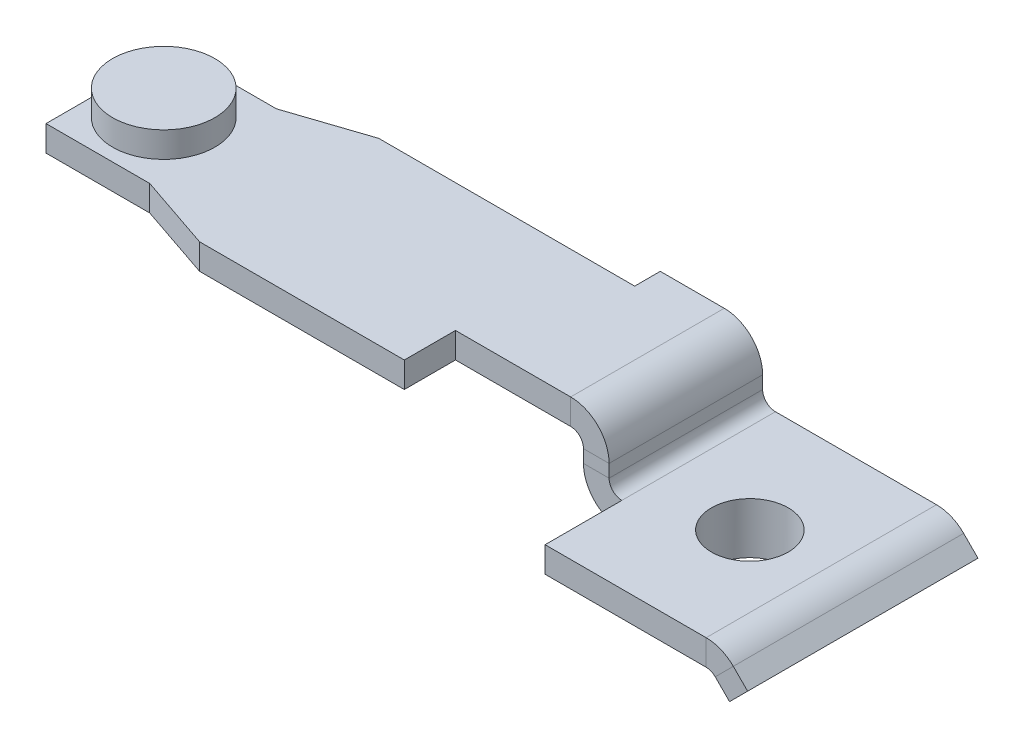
ISO-10303-21;
HEADER;
FILE_DESCRIPTION(('STEP AP214'),'2;1');
FILE_NAME('part.step','',(''),(''),'','','');
FILE_SCHEMA(('AUTOMOTIVE_DESIGN { 1 0 10303 214 1 1 1 1 }'));
ENDSEC;
DATA;
#1=APPLICATION_CONTEXT('core data for automotive mechanical design processes');
#2=APPLICATION_PROTOCOL_DEFINITION('international standard','automotive_design',2000,#1);
#3=PRODUCT_CONTEXT('',#1,'mechanical');
#4=PRODUCT('Part','Part','',(#3));
#5=PRODUCT_RELATED_PRODUCT_CATEGORY('part','',(#4));
#6=PRODUCT_DEFINITION_FORMATION('','',#4);
#7=PRODUCT_DEFINITION_CONTEXT('part definition',#1,'design');
#8=PRODUCT_DEFINITION('design','',#6,#7);
#9=PRODUCT_DEFINITION_SHAPE('','',#8);
#10=(LENGTH_UNIT() NAMED_UNIT(*) SI_UNIT(.MILLI.,.METRE.));
#11=(NAMED_UNIT(*) PLANE_ANGLE_UNIT() SI_UNIT($,.RADIAN.));
#12=(NAMED_UNIT(*) SI_UNIT($,.STERADIAN.) SOLID_ANGLE_UNIT());
#13=UNCERTAINTY_MEASURE_WITH_UNIT(LENGTH_MEASURE(1.E-05),#10,'distance_accuracy_value','');
#14=(GEOMETRIC_REPRESENTATION_CONTEXT(3) GLOBAL_UNCERTAINTY_ASSIGNED_CONTEXT((#13)) GLOBAL_UNIT_ASSIGNED_CONTEXT((#10,
#11,#12)) REPRESENTATION_CONTEXT('',''));
#15=CARTESIAN_POINT('',(0.,0.,0.));
#16=DIRECTION('',(0.,0.,1.));
#17=DIRECTION('',(1.,0.,0.));
#18=AXIS2_PLACEMENT_3D('',#15,#16,#17);
#19=CARTESIAN_POINT('',(-5.,3.49999999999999,1.5));
#20=DIRECTION('',(0.,1.,0.));
#21=DIRECTION('',(-1.,0.,0.));
#22=AXIS2_PLACEMENT_3D('',#19,#20,#21);
#23=PLANE('',#22);
#24=DIRECTION('',(0.,0.,-1.));
#25=VECTOR('',#24,1.);
#26=CARTESIAN_POINT('',(-25.,3.5,1.5));
#27=LINE('',#26,#25);
#28=CARTESIAN_POINT('',(-25.,3.5,-2.5));
#29=VERTEX_POINT('',#28);
#30=CARTESIAN_POINT('',(-25.,3.5,2.5));
#31=VERTEX_POINT('',#30);
#32=EDGE_CURVE('E289',#29,#31,#27,.F.);
#33=ORIENTED_EDGE('',*,*,#32,.T.);
#34=DIRECTION('',(-1.,0.,0.));
#35=VECTOR('',#34,1.);
#36=CARTESIAN_POINT('',(-25.,3.5,2.5));
#37=LINE('',#36,#35);
#38=CARTESIAN_POINT('',(-20.9464362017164,3.5,2.49999999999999));
#39=VERTEX_POINT('',#38);
#40=EDGE_CURVE('E263',#39,#31,#37,.T.);
#41=ORIENTED_EDGE('',*,*,#40,.F.);
#42=DIRECTION('',(-0.946947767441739,0.,-0.321387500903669));
#43=VECTOR('',#42,1.);
#44=CARTESIAN_POINT('',(-20.9464362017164,3.5,2.49999999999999));
#45=LINE('',#44,#43);
#46=CARTESIAN_POINT('',(-18.,3.5,3.5));
#47=VERTEX_POINT('',#46);
#48=EDGE_CURVE('E246',#47,#39,#45,.T.);
#49=ORIENTED_EDGE('',*,*,#48,.F.);
#50=DIRECTION('',(1.,0.,0.));
#51=VECTOR('',#50,1.);
#52=CARTESIAN_POINT('',(-10.,3.5,3.5));
#53=LINE('',#52,#51);
#54=CARTESIAN_POINT('',(-10.,3.5,3.5));
#55=VERTEX_POINT('',#54);
#56=EDGE_CURVE('E261',#47,#55,#53,.T.);
#57=ORIENTED_EDGE('',*,*,#56,.T.);
#58=DIRECTION('',(0.,0.,-1.));
#59=VECTOR('',#58,1.);
#60=CARTESIAN_POINT('',(-10.,3.5,1.5));
#61=LINE('',#60,#59);
#62=CARTESIAN_POINT('',(-10.,3.49999999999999,1.5));
#63=VERTEX_POINT('',#62);
#64=EDGE_CURVE('E271',#55,#63,#61,.T.);
#65=ORIENTED_EDGE('',*,*,#64,.T.);
#66=DIRECTION('',(-1.,0.,0.));
#67=VECTOR('',#66,1.);
#68=CARTESIAN_POINT('',(-5.,3.49999999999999,1.5));
#69=LINE('',#68,#67);
#70=CARTESIAN_POINT('',(-5.5,3.49999999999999,1.5));
#71=VERTEX_POINT('',#70);
#72=EDGE_CURVE('E286',#63,#71,#69,.F.);
#73=ORIENTED_EDGE('',*,*,#72,.T.);
#74=DIRECTION('',(0.,0.,-1.));
#75=VECTOR('',#74,1.);
#76=CARTESIAN_POINT('',(-5.5,3.49999999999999,1.5));
#77=LINE('',#76,#75);
#78=CARTESIAN_POINT('',(-5.5,3.49999999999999,-4.5));
#79=VERTEX_POINT('',#78);
#80=EDGE_CURVE('E302',#71,#79,#77,.T.);
#81=ORIENTED_EDGE('',*,*,#80,.T.);
#82=DIRECTION('',(1.,0.,0.));
#83=VECTOR('',#82,1.);
#84=CARTESIAN_POINT('',(-5.00000000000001,3.49999999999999,-4.5));
#85=LINE('',#84,#83);
#86=CARTESIAN_POINT('',(-8.,3.49999999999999,-4.5));
#87=VERTEX_POINT('',#86);
#88=EDGE_CURVE('E291',#79,#87,#85,.F.);
#89=ORIENTED_EDGE('',*,*,#88,.T.);
#90=DIRECTION('',(0.,0.,-1.));
#91=VECTOR('',#90,1.);
#92=CARTESIAN_POINT('',(-8.,3.49999999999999,-4.5));
#93=LINE('',#92,#91);
#94=CARTESIAN_POINT('',(-8.,3.49999999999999,-3.5));
#95=VERTEX_POINT('',#94);
#96=EDGE_CURVE('E562',#95,#87,#93,.T.);
#97=ORIENTED_EDGE('',*,*,#96,.F.);
#98=DIRECTION('',(1.,0.,0.));
#99=VECTOR('',#98,1.);
#100=CARTESIAN_POINT('',(-25.,3.5,-3.49999999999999));
#101=LINE('',#100,#99);
#102=CARTESIAN_POINT('',(-18.,3.5,-3.5));
#103=VERTEX_POINT('',#102);
#104=EDGE_CURVE('E564',#103,#95,#101,.T.);
#105=ORIENTED_EDGE('',*,*,#104,.F.);
#106=DIRECTION('',(0.948683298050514,0.,-0.316227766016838));
#107=VECTOR('',#106,1.);
#108=CARTESIAN_POINT('',(-21.,3.5,-2.5));
#109=LINE('',#108,#107);
#110=CARTESIAN_POINT('',(-21.,3.5,-2.5));
#111=VERTEX_POINT('',#110);
#112=EDGE_CURVE('E580',#111,#103,#109,.T.);
#113=ORIENTED_EDGE('',*,*,#112,.F.);
#114=DIRECTION('',(1.,0.,0.));
#115=VECTOR('',#114,1.);
#116=CARTESIAN_POINT('',(-25.,3.5,-2.5));
#117=LINE('',#116,#115);
#118=EDGE_CURVE('E582',#29,#111,#117,.T.);
#119=ORIENTED_EDGE('',*,*,#118,.F.);
#120=EDGE_LOOP('',(#33,#41,#49,#57,#65,#73,#81,#89,#97,#105,#113,#119));
#121=FACE_BOUND('',#120,.T.);
#122=CARTESIAN_POINT('',(-22.9,3.5,0.));
#123=DIRECTION('',(0.,1.,0.));
#124=DIRECTION('',(-1.,0.,0.));
#125=AXIS2_PLACEMENT_3D('',#122,#123,#124);
#126=CIRCLE('',#125,2.);
#127=CARTESIAN_POINT('',(-24.9,3.5,0.));
#128=VERTEX_POINT('',#127);
#129=EDGE_CURVE('E593',#128,#128,#126,.T.);
#130=ORIENTED_EDGE('',*,*,#129,.F.);
#131=EDGE_LOOP('',(#130));
#132=FACE_BOUND('',#131,.T.);
#133=ADVANCED_FACE('F68',(#121,#132),#23,.T.);
#134=CARTESIAN_POINT('',(-5.,2.49999999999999,1.5));
#135=DIRECTION('',(0.,1.,0.));
#136=DIRECTION('',(-1.,0.,0.));
#137=AXIS2_PLACEMENT_3D('',#134,#135,#136);
#138=PLANE('',#137);
#139=DIRECTION('',(-1.,0.,0.));
#140=VECTOR('',#139,1.);
#141=CARTESIAN_POINT('',(-5.,2.49999999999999,2.49999999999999));
#142=LINE('',#141,#140);
#143=CARTESIAN_POINT('',(-20.9464362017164,2.5,2.49999999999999));
#144=VERTEX_POINT('',#143);
#145=CARTESIAN_POINT('',(-25.,2.5,2.5));
#146=VERTEX_POINT('',#145);
#147=EDGE_CURVE('E254',#144,#146,#142,.T.);
#148=ORIENTED_EDGE('',*,*,#147,.T.);
#149=DIRECTION('',(0.,0.,1.));
#150=VECTOR('',#149,1.);
#151=CARTESIAN_POINT('',(-25.,2.5,1.5));
#152=LINE('',#151,#150);
#153=CARTESIAN_POINT('',(-25.,2.5,-2.5));
#154=VERTEX_POINT('',#153);
#155=EDGE_CURVE('E296',#154,#146,#152,.T.);
#156=ORIENTED_EDGE('',*,*,#155,.F.);
#157=DIRECTION('',(-1.,0.,0.));
#158=VECTOR('',#157,1.);
#159=CARTESIAN_POINT('',(-5.,2.49999999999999,-2.5));
#160=LINE('',#159,#158);
#161=CARTESIAN_POINT('',(-21.,2.5,-2.5));
#162=VERTEX_POINT('',#161);
#163=EDGE_CURVE('E577',#154,#162,#160,.F.);
#164=ORIENTED_EDGE('',*,*,#163,.T.);
#165=DIRECTION('',(0.948683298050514,0.,-0.316227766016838));
#166=VECTOR('',#165,1.);
#167=CARTESIAN_POINT('',(-21.,2.5,-2.5));
#168=LINE('',#167,#166);
#169=CARTESIAN_POINT('',(-18.,2.5,-3.5));
#170=VERTEX_POINT('',#169);
#171=EDGE_CURVE('E571',#162,#170,#168,.T.);
#172=ORIENTED_EDGE('',*,*,#171,.T.);
#173=DIRECTION('',(1.,0.,0.));
#174=VECTOR('',#173,1.);
#175=CARTESIAN_POINT('',(-25.,2.5,-3.49999999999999));
#176=LINE('',#175,#174);
#177=CARTESIAN_POINT('',(-8.,2.49999999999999,-3.5));
#178=VERTEX_POINT('',#177);
#179=EDGE_CURVE('E560',#170,#178,#176,.T.);
#180=ORIENTED_EDGE('',*,*,#179,.T.);
#181=DIRECTION('',(0.,0.,-1.));
#182=VECTOR('',#181,1.);
#183=CARTESIAN_POINT('',(-8.,2.49999999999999,-4.5));
#184=LINE('',#183,#182);
#185=CARTESIAN_POINT('',(-8.,2.49999999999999,-4.5));
#186=VERTEX_POINT('',#185);
#187=EDGE_CURVE('E557',#178,#186,#184,.T.);
#188=ORIENTED_EDGE('',*,*,#187,.T.);
#189=DIRECTION('',(-1.,0.,0.));
#190=VECTOR('',#189,1.);
#191=CARTESIAN_POINT('',(-25.,2.5,-4.49999999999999));
#192=LINE('',#191,#190);
#193=CARTESIAN_POINT('',(-5.5,2.49999999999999,-4.5));
#194=VERTEX_POINT('',#193);
#195=EDGE_CURVE('E299',#194,#186,#192,.T.);
#196=ORIENTED_EDGE('',*,*,#195,.F.);
#197=DIRECTION('',(0.,0.,1.));
#198=VECTOR('',#197,1.);
#199=CARTESIAN_POINT('',(-5.5,2.49999999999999,1.5));
#200=LINE('',#199,#198);
#201=CARTESIAN_POINT('',(-5.5,2.49999999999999,1.5));
#202=VERTEX_POINT('',#201);
#203=EDGE_CURVE('E308',#202,#194,#200,.F.);
#204=ORIENTED_EDGE('',*,*,#203,.F.);
#205=DIRECTION('',(1.,0.,0.));
#206=VECTOR('',#205,1.);
#207=CARTESIAN_POINT('',(-5.,2.49999999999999,1.5));
#208=LINE('',#207,#206);
#209=CARTESIAN_POINT('',(-10.,2.49999999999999,1.5));
#210=VERTEX_POINT('',#209);
#211=EDGE_CURVE('E294',#210,#202,#208,.T.);
#212=ORIENTED_EDGE('',*,*,#211,.F.);
#213=DIRECTION('',(0.,0.,-1.));
#214=VECTOR('',#213,1.);
#215=CARTESIAN_POINT('',(-10.,2.5,1.5));
#216=LINE('',#215,#214);
#217=CARTESIAN_POINT('',(-10.,2.5,3.5));
#218=VERTEX_POINT('',#217);
#219=EDGE_CURVE('E270',#218,#210,#216,.T.);
#220=ORIENTED_EDGE('',*,*,#219,.F.);
#221=DIRECTION('',(1.,0.,0.));
#222=VECTOR('',#221,1.);
#223=CARTESIAN_POINT('',(-10.,2.5,3.5));
#224=LINE('',#223,#222);
#225=CARTESIAN_POINT('',(-18.,2.5,3.5));
#226=VERTEX_POINT('',#225);
#227=EDGE_CURVE('E274',#226,#218,#224,.T.);
#228=ORIENTED_EDGE('',*,*,#227,.F.);
#229=DIRECTION('',(-0.946947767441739,0.,-0.321387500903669));
#230=VECTOR('',#229,1.);
#231=CARTESIAN_POINT('',(-20.9464362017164,2.5,2.49999999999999));
#232=LINE('',#231,#230);
#233=EDGE_CURVE('E249',#226,#144,#232,.T.);
#234=ORIENTED_EDGE('',*,*,#233,.T.);
#235=EDGE_LOOP('',(#148,#156,#164,#172,#180,#188,#196,#204,#212,#220,#228,#234));
#236=FACE_BOUND('',#235,.T.);
#237=ADVANCED_FACE('F599',(#236),#138,.F.);
#238=CARTESIAN_POINT('',(-25.,3.5,1.5));
#239=DIRECTION('',(1.,0.,0.));
#240=DIRECTION('',(0.,1.,0.));
#241=AXIS2_PLACEMENT_3D('',#238,#239,#240);
#242=PLANE('',#241);
#243=DIRECTION('',(0.,1.,0.));
#244=VECTOR('',#243,1.);
#245=CARTESIAN_POINT('',(-25.,3.5,2.5));
#246=LINE('',#245,#244);
#247=EDGE_CURVE('E253',#31,#146,#246,.F.);
#248=ORIENTED_EDGE('',*,*,#247,.F.);
#249=ORIENTED_EDGE('',*,*,#32,.F.);
#250=DIRECTION('',(0.,1.,0.));
#251=VECTOR('',#250,1.);
#252=CARTESIAN_POINT('',(-25.,3.5,-2.5));
#253=LINE('',#252,#251);
#254=EDGE_CURVE('E570',#29,#154,#253,.F.);
#255=ORIENTED_EDGE('',*,*,#254,.T.);
#256=ORIENTED_EDGE('',*,*,#155,.T.);
#257=EDGE_LOOP('',(#248,#249,#255,#256));
#258=FACE_BOUND('',#257,.T.);
#259=ADVANCED_FACE('F606',(#258),#242,.F.);
#260=CARTESIAN_POINT('',(-10.,2.5,3.5));
#261=DIRECTION('',(0.,0.,1.));
#262=DIRECTION('',(0.,-1.,0.));
#263=AXIS2_PLACEMENT_3D('',#260,#261,#262);
#264=PLANE('',#263);
#265=ORIENTED_EDGE('',*,*,#56,.F.);
#266=DIRECTION('',(0.,1.,0.));
#267=VECTOR('',#266,1.);
#268=CARTESIAN_POINT('',(-18.,3.5,3.5));
#269=LINE('',#268,#267);
#270=EDGE_CURVE('E242',#47,#226,#269,.F.);
#271=ORIENTED_EDGE('',*,*,#270,.T.);
#272=ORIENTED_EDGE('',*,*,#227,.T.);
#273=DIRECTION('',(0.,1.,0.));
#274=VECTOR('',#273,1.);
#275=CARTESIAN_POINT('',(-10.,2.5,3.5));
#276=LINE('',#275,#274);
#277=EDGE_CURVE('E268',#218,#55,#276,.T.);
#278=ORIENTED_EDGE('',*,*,#277,.T.);
#279=EDGE_LOOP('',(#265,#271,#272,#278));
#280=FACE_BOUND('',#279,.T.);
#281=ADVANCED_FACE('F266',(#280),#264,.T.);
#282=CARTESIAN_POINT('',(-25.,2.5,-3.49999999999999));
#283=DIRECTION('',(0.,0.,1.));
#284=DIRECTION('',(1.,0.,0.));
#285=AXIS2_PLACEMENT_3D('',#282,#283,#284);
#286=PLANE('',#285);
#287=DIRECTION('',(0.,1.,0.));
#288=VECTOR('',#287,1.);
#289=CARTESIAN_POINT('',(-18.,3.5,-3.5));
#290=LINE('',#289,#288);
#291=EDGE_CURVE('E566',#103,#170,#290,.F.);
#292=ORIENTED_EDGE('',*,*,#291,.F.);
#293=ORIENTED_EDGE('',*,*,#104,.T.);
#294=DIRECTION('',(0.,1.,0.));
#295=VECTOR('',#294,1.);
#296=CARTESIAN_POINT('',(-8.,2.49999999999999,-3.5));
#297=LINE('',#296,#295);
#298=EDGE_CURVE('E554',#178,#95,#297,.T.);
#299=ORIENTED_EDGE('',*,*,#298,.F.);
#300=ORIENTED_EDGE('',*,*,#179,.F.);
#301=EDGE_LOOP('',(#292,#293,#299,#300));
#302=FACE_BOUND('',#301,.T.);
#303=ADVANCED_FACE('F689',(#302),#286,.F.);
#304=CARTESIAN_POINT('',(-3.5,0.,4.5));
#305=DIRECTION('',(0.,1.,0.));
#306=DIRECTION('',(0.,0.,1.));
#307=AXIS2_PLACEMENT_3D('',#304,#305,#306);
#308=PLANE('',#307);
#309=DIRECTION('',(0.,0.,1.));
#310=VECTOR('',#309,1.);
#311=CARTESIAN_POINT('',(2.79289321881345,0.,4.5));
#312=LINE('',#311,#310);
#313=CARTESIAN_POINT('',(2.79289321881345,0.,-1.09532984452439));
#314=VERTEX_POINT('',#313);
#315=CARTESIAN_POINT('',(2.79289321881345,0.,-4.5));
#316=VERTEX_POINT('',#315);
#317=EDGE_CURVE('E360',#314,#316,#312,.F.);
#318=ORIENTED_EDGE('',*,*,#317,.F.);
#319=CARTESIAN_POINT('',(0.,0.,0.));
#320=DIRECTION('',(0.,1.,0.));
#321=DIRECTION('',(0.,0.,1.));
#322=AXIS2_PLACEMENT_3D('',#319,#320,#321);
#323=CIRCLE('',#322,3.);
#324=CARTESIAN_POINT('',(2.79289321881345,0.,1.09532984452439));
#325=VERTEX_POINT('',#324);
#326=EDGE_CURVE('E81',#314,#325,#323,.T.);
#327=ORIENTED_EDGE('',*,*,#326,.T.);
#328=CARTESIAN_POINT('',(2.79289321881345,0.,4.5));
#329=VERTEX_POINT('',#328);
#330=EDGE_CURVE('E358',#329,#325,#312,.F.);
#331=ORIENTED_EDGE('',*,*,#330,.F.);
#332=DIRECTION('',(1.,0.,0.));
#333=VECTOR('',#332,1.);
#334=CARTESIAN_POINT('',(-3.5,0.,4.5));
#335=LINE('',#334,#333);
#336=CARTESIAN_POINT('',(-3.5,0.,4.5));
#337=VERTEX_POINT('',#336);
#338=EDGE_CURVE('E507',#337,#329,#335,.T.);
#339=ORIENTED_EDGE('',*,*,#338,.F.);
#340=DIRECTION('',(0.,0.,1.));
#341=VECTOR('',#340,1.);
#342=CARTESIAN_POINT('',(-3.5,0.,-4.5));
#343=LINE('',#342,#341);
#344=CARTESIAN_POINT('',(-3.5,0.,1.5));
#345=VERTEX_POINT('',#344);
#346=EDGE_CURVE('E434',#345,#337,#343,.T.);
#347=ORIENTED_EDGE('',*,*,#346,.F.);
#348=CARTESIAN_POINT('',(-3.5,0.,-4.5));
#349=VERTEX_POINT('',#348);
#350=EDGE_CURVE('E504',#349,#345,#343,.T.);
#351=ORIENTED_EDGE('',*,*,#350,.F.);
#352=DIRECTION('',(-1.,0.,0.));
#353=VECTOR('',#352,1.);
#354=CARTESIAN_POINT('',(-3.5,0.,-4.5));
#355=LINE('',#354,#353);
#356=EDGE_CURVE('E510',#316,#349,#355,.T.);
#357=ORIENTED_EDGE('',*,*,#356,.F.);
#358=EDGE_LOOP('',(#318,#327,#331,#339,#347,#351,#357));
#359=FACE_BOUND('',#358,.T.);
#360=ADVANCED_FACE('F446',(#359),#308,.F.);
#361=CARTESIAN_POINT('',(-3.5,1.,4.5));
#362=DIRECTION('',(0.,0.,-1.));
#363=DIRECTION('',(-1.,0.,0.));
#364=AXIS2_PLACEMENT_3D('',#361,#362,#363);
#365=PLANE('',#364);
#366=DIRECTION('',(0.,1.,0.));
#367=VECTOR('',#366,1.);
#368=CARTESIAN_POINT('',(2.79289321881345,0.,4.5));
#369=LINE('',#368,#367);
#370=CARTESIAN_POINT('',(2.79289321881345,1.,4.5));
#371=VERTEX_POINT('',#370);
#372=EDGE_CURVE('E369',#329,#371,#369,.T.);
#373=ORIENTED_EDGE('',*,*,#372,.T.);
#374=DIRECTION('',(1.,0.,0.));
#375=VECTOR('',#374,1.);
#376=CARTESIAN_POINT('',(-3.5,1.,4.5));
#377=LINE('',#376,#375);
#378=CARTESIAN_POINT('',(-3.5,1.,4.5));
#379=VERTEX_POINT('',#378);
#380=EDGE_CURVE('E490',#379,#371,#377,.T.);
#381=ORIENTED_EDGE('',*,*,#380,.F.);
#382=DIRECTION('',(0.,-1.,0.));
#383=VECTOR('',#382,1.);
#384=CARTESIAN_POINT('',(-3.5,1.,4.5));
#385=LINE('',#384,#383);
#386=EDGE_CURVE('E443',#379,#337,#385,.T.);
#387=ORIENTED_EDGE('',*,*,#386,.T.);
#388=ORIENTED_EDGE('',*,*,#338,.T.);
#389=EDGE_LOOP('',(#373,#381,#387,#388));
#390=FACE_BOUND('',#389,.T.);
#391=ADVANCED_FACE('F515',(#390),#365,.F.);
#392=CARTESIAN_POINT('',(-3.5,1.,-4.5));
#393=DIRECTION('',(0.,0.,1.));
#394=DIRECTION('',(1.,0.,0.));
#395=AXIS2_PLACEMENT_3D('',#392,#393,#394);
#396=PLANE('',#395);
#397=DIRECTION('',(0.,1.,0.));
#398=VECTOR('',#397,1.);
#399=CARTESIAN_POINT('',(2.79289321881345,0.,-4.5));
#400=LINE('',#399,#398);
#401=CARTESIAN_POINT('',(2.79289321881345,1.,-4.5));
#402=VERTEX_POINT('',#401);
#403=EDGE_CURVE('E372',#316,#402,#400,.T.);
#404=ORIENTED_EDGE('',*,*,#403,.F.);
#405=ORIENTED_EDGE('',*,*,#356,.T.);
#406=DIRECTION('',(0.,-1.,0.));
#407=VECTOR('',#406,1.);
#408=CARTESIAN_POINT('',(-3.5,1.,-4.5));
#409=LINE('',#408,#407);
#410=CARTESIAN_POINT('',(-3.5,1.,-4.5));
#411=VERTEX_POINT('',#410);
#412=EDGE_CURVE('E494',#411,#349,#409,.T.);
#413=ORIENTED_EDGE('',*,*,#412,.F.);
#414=DIRECTION('',(-1.,0.,0.));
#415=VECTOR('',#414,1.);
#416=CARTESIAN_POINT('',(-3.5,1.,-4.5));
#417=LINE('',#416,#415);
#418=EDGE_CURVE('E487',#402,#411,#417,.T.);
#419=ORIENTED_EDGE('',*,*,#418,.F.);
#420=EDGE_LOOP('',(#404,#405,#413,#419));
#421=FACE_BOUND('',#420,.T.);
#422=ADVANCED_FACE('F492',(#421),#396,.F.);
#423=CARTESIAN_POINT('',(-3.5,1.,4.5));
#424=DIRECTION('',(0.,1.,0.));
#425=DIRECTION('',(0.,0.,1.));
#426=AXIS2_PLACEMENT_3D('',#423,#424,#425);
#427=PLANE('',#426);
#428=CARTESIAN_POINT('',(0.,1.,0.));
#429=DIRECTION('',(0.,1.,0.));
#430=DIRECTION('',(0.,0.,1.));
#431=AXIS2_PLACEMENT_3D('',#428,#429,#430);
#432=CIRCLE('',#431,1.5);
#433=CARTESIAN_POINT('',(0.,1.,1.5));
#434=VERTEX_POINT('',#433);
#435=EDGE_CURVE('E383',#434,#434,#432,.T.);
#436=ORIENTED_EDGE('',*,*,#435,.F.);
#437=EDGE_LOOP('',(#436));
#438=FACE_BOUND('',#437,.T.);
#439=ORIENTED_EDGE('',*,*,#380,.T.);
#440=DIRECTION('',(0.,0.,1.));
#441=VECTOR('',#440,1.);
#442=CARTESIAN_POINT('',(2.79289321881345,1.,4.5));
#443=LINE('',#442,#441);
#444=EDGE_CURVE('E363',#371,#402,#443,.F.);
#445=ORIENTED_EDGE('',*,*,#444,.T.);
#446=ORIENTED_EDGE('',*,*,#418,.T.);
#447=DIRECTION('',(0.,0.,1.));
#448=VECTOR('',#447,1.);
#449=CARTESIAN_POINT('',(-3.5,1.,-4.5));
#450=LINE('',#449,#448);
#451=CARTESIAN_POINT('',(-3.5,1.,1.5));
#452=VERTEX_POINT('',#451);
#453=EDGE_CURVE('E497',#411,#452,#450,.T.);
#454=ORIENTED_EDGE('',*,*,#453,.T.);
#455=EDGE_CURVE('E508',#452,#379,#450,.T.);
#456=ORIENTED_EDGE('',*,*,#455,.T.);
#457=EDGE_LOOP('',(#439,#445,#446,#454,#456));
#458=FACE_BOUND('',#457,.T.);
#459=ADVANCED_FACE('F485',(#438,#458),#427,.T.);
#460=CARTESIAN_POINT('',(-3.5,1.,-4.5));
#461=DIRECTION('',(1.,0.,0.));
#462=DIRECTION('',(0.,0.,-1.));
#463=AXIS2_PLACEMENT_3D('',#460,#461,#462);
#464=PLANE('',#463);
#465=ORIENTED_EDGE('',*,*,#455,.F.);
#466=DIRECTION('',(0.,-1.,0.));
#467=VECTOR('',#466,1.);
#468=CARTESIAN_POINT('',(-3.5,1.,1.5));
#469=LINE('',#468,#467);
#470=EDGE_CURVE('E425',#452,#345,#469,.T.);
#471=ORIENTED_EDGE('',*,*,#470,.T.);
#472=ORIENTED_EDGE('',*,*,#346,.T.);
#473=ORIENTED_EDGE('',*,*,#386,.F.);
#474=EDGE_LOOP('',(#465,#471,#472,#473));
#475=FACE_BOUND('',#474,.T.);
#476=ADVANCED_FACE('F70',(#475),#464,.F.);
#477=CARTESIAN_POINT('',(-3.5,1.5,-4.5));
#478=DIRECTION('',(0.,0.,-1.));
#479=DIRECTION('',(-1.,0.,0.));
#480=AXIS2_PLACEMENT_3D('',#477,#478,#479);
#481=PLANE('',#480);
#482=DIRECTION('',(1.,0.,0.));
#483=VECTOR('',#482,1.);
#484=CARTESIAN_POINT('',(-5.,1.5,-4.5));
#485=LINE('',#484,#483);
#486=CARTESIAN_POINT('',(-4.,1.5,-4.5));
#487=VERTEX_POINT('',#486);
#488=CARTESIAN_POINT('',(-5.,1.5,-4.5));
#489=VERTEX_POINT('',#488);
#490=EDGE_CURVE('E386',#487,#489,#485,.F.);
#491=ORIENTED_EDGE('',*,*,#490,.F.);
#492=CARTESIAN_POINT('',(-3.5,1.5,-4.5));
#493=DIRECTION('',(0.,0.,1.));
#494=DIRECTION('',(1.,0.,0.));
#495=AXIS2_PLACEMENT_3D('',#492,#493,#494);
#496=CIRCLE('',#495,0.5);
#497=EDGE_CURVE('E418',#411,#487,#496,.F.);
#498=ORIENTED_EDGE('',*,*,#497,.F.);
#499=ORIENTED_EDGE('',*,*,#412,.T.);
#500=CARTESIAN_POINT('',(-3.5,1.5,-4.5));
#501=DIRECTION('',(0.,0.,1.));
#502=DIRECTION('',(1.,0.,0.));
#503=AXIS2_PLACEMENT_3D('',#500,#501,#502);
#504=CIRCLE('',#503,1.5);
#505=EDGE_CURVE('E422',#349,#489,#504,.F.);
#506=ORIENTED_EDGE('',*,*,#505,.T.);
#507=EDGE_LOOP('',(#491,#498,#499,#506));
#508=FACE_BOUND('',#507,.T.);
#509=ADVANCED_FACE('F681',(#508),#481,.T.);
#510=CARTESIAN_POINT('',(-3.5,1.5,1.5));
#511=DIRECTION('',(0.,0.,-1.));
#512=DIRECTION('',(-1.,0.,0.));
#513=AXIS2_PLACEMENT_3D('',#510,#511,#512);
#514=PLANE('',#513);
#515=CARTESIAN_POINT('',(-3.5,1.5,1.5));
#516=DIRECTION('',(0.,0.,1.));
#517=DIRECTION('',(1.,0.,0.));
#518=AXIS2_PLACEMENT_3D('',#515,#516,#517);
#519=CIRCLE('',#518,0.5);
#520=CARTESIAN_POINT('',(-4.,1.5,1.5));
#521=VERTEX_POINT('',#520);
#522=EDGE_CURVE('E390',#521,#452,#519,.T.);
#523=ORIENTED_EDGE('',*,*,#522,.F.);
#524=DIRECTION('',(1.,0.,0.));
#525=VECTOR('',#524,1.);
#526=CARTESIAN_POINT('',(-4.,1.5,1.5));
#527=LINE('',#526,#525);
#528=CARTESIAN_POINT('',(-5.,1.5,1.5));
#529=VERTEX_POINT('',#528);
#530=EDGE_CURVE('E411',#521,#529,#527,.F.);
#531=ORIENTED_EDGE('',*,*,#530,.T.);
#532=CARTESIAN_POINT('',(-3.5,1.5,1.5));
#533=DIRECTION('',(0.,0.,1.));
#534=DIRECTION('',(1.,0.,0.));
#535=AXIS2_PLACEMENT_3D('',#532,#533,#534);
#536=CIRCLE('',#535,1.5);
#537=EDGE_CURVE('E421',#529,#345,#536,.T.);
#538=ORIENTED_EDGE('',*,*,#537,.T.);
#539=ORIENTED_EDGE('',*,*,#470,.F.);
#540=EDGE_LOOP('',(#523,#531,#538,#539));
#541=FACE_BOUND('',#540,.T.);
#542=ADVANCED_FACE('F523',(#541),#514,.F.);
#543=CARTESIAN_POINT('',(-3.5,1.5,1.5));
#544=DIRECTION('',(0.,0.,1.));
#545=DIRECTION('',(-1.,0.,0.));
#546=AXIS2_PLACEMENT_3D('',#543,#544,#545);
#547=CYLINDRICAL_SURFACE('',#546,1.5);
#548=ORIENTED_EDGE('',*,*,#350,.T.);
#549=ORIENTED_EDGE('',*,*,#537,.F.);
#550=DIRECTION('',(0.,0.,1.));
#551=VECTOR('',#550,1.);
#552=CARTESIAN_POINT('',(-5.,1.5,-4.5));
#553=LINE('',#552,#551);
#554=EDGE_CURVE('E409',#529,#489,#553,.F.);
#555=ORIENTED_EDGE('',*,*,#554,.T.);
#556=ORIENTED_EDGE('',*,*,#505,.F.);
#557=EDGE_LOOP('',(#548,#549,#555,#556));
#558=FACE_BOUND('',#557,.T.);
#559=ADVANCED_FACE('F677',(#558),#547,.T.);
#560=CARTESIAN_POINT('',(-3.5,1.5,1.5));
#561=DIRECTION('',(0.,0.,1.));
#562=DIRECTION('',(-1.,0.,0.));
#563=AXIS2_PLACEMENT_3D('',#560,#561,#562);
#564=CYLINDRICAL_SURFACE('',#563,0.5);
#565=ORIENTED_EDGE('',*,*,#453,.F.);
#566=ORIENTED_EDGE('',*,*,#497,.T.);
#567=DIRECTION('',(0.,0.,1.));
#568=VECTOR('',#567,1.);
#569=CARTESIAN_POINT('',(-4.,1.5,-4.5));
#570=LINE('',#569,#568);
#571=EDGE_CURVE('E414',#487,#521,#570,.T.);
#572=ORIENTED_EDGE('',*,*,#571,.T.);
#573=ORIENTED_EDGE('',*,*,#522,.T.);
#574=EDGE_LOOP('',(#565,#566,#572,#573));
#575=FACE_BOUND('',#574,.T.);
#576=ADVANCED_FACE('F526',(#575),#564,.F.);
#577=CARTESIAN_POINT('',(-5.,0.999999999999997,-4.5));
#578=DIRECTION('',(0.,0.,1.));
#579=DIRECTION('',(1.,0.,0.));
#580=AXIS2_PLACEMENT_3D('',#577,#578,#579);
#581=PLANE('',#580);
#582=ORIENTED_EDGE('',*,*,#490,.T.);
#583=DIRECTION('',(0.,-1.,0.));
#584=VECTOR('',#583,1.);
#585=CARTESIAN_POINT('',(-5.,2.,-4.5));
#586=LINE('',#585,#584);
#587=CARTESIAN_POINT('',(-5.,2.,-4.5));
#588=VERTEX_POINT('',#587);
#589=EDGE_CURVE('E398',#588,#489,#586,.T.);
#590=ORIENTED_EDGE('',*,*,#589,.F.);
#591=DIRECTION('',(1.,0.,0.));
#592=VECTOR('',#591,1.);
#593=CARTESIAN_POINT('',(-5.,2.,-4.5));
#594=LINE('',#593,#592);
#595=CARTESIAN_POINT('',(-4.,2.,-4.5));
#596=VERTEX_POINT('',#595);
#597=EDGE_CURVE('E391',#588,#596,#594,.T.);
#598=ORIENTED_EDGE('',*,*,#597,.T.);
#599=DIRECTION('',(0.,1.,0.));
#600=VECTOR('',#599,1.);
#601=CARTESIAN_POINT('',(-4.,1.,-4.5));
#602=LINE('',#601,#600);
#603=EDGE_CURVE('E406',#596,#487,#602,.F.);
#604=ORIENTED_EDGE('',*,*,#603,.T.);
#605=EDGE_LOOP('',(#582,#590,#598,#604));
#606=FACE_BOUND('',#605,.T.);
#607=ADVANCED_FACE('F534',(#606),#581,.F.);
#608=CARTESIAN_POINT('',(-5.,2.,1.5));
#609=DIRECTION('',(0.,0.,-1.));
#610=DIRECTION('',(-1.,0.,0.));
#611=AXIS2_PLACEMENT_3D('',#608,#609,#610);
#612=PLANE('',#611);
#613=ORIENTED_EDGE('',*,*,#530,.F.);
#614=DIRECTION('',(0.,-1.,0.));
#615=VECTOR('',#614,1.);
#616=CARTESIAN_POINT('',(-4.,2.,1.5));
#617=LINE('',#616,#615);
#618=CARTESIAN_POINT('',(-4.,2.,1.5));
#619=VERTEX_POINT('',#618);
#620=EDGE_CURVE('E404',#521,#619,#617,.F.);
#621=ORIENTED_EDGE('',*,*,#620,.T.);
#622=DIRECTION('',(1.,0.,0.));
#623=VECTOR('',#622,1.);
#624=CARTESIAN_POINT('',(-5.,2.,1.5));
#625=LINE('',#624,#623);
#626=CARTESIAN_POINT('',(-5.,2.,1.5));
#627=VERTEX_POINT('',#626);
#628=EDGE_CURVE('E387',#627,#619,#625,.T.);
#629=ORIENTED_EDGE('',*,*,#628,.F.);
#630=DIRECTION('',(0.,1.,0.));
#631=VECTOR('',#630,1.);
#632=CARTESIAN_POINT('',(-5.,2.,1.5));
#633=LINE('',#632,#631);
#634=EDGE_CURVE('E396',#529,#627,#633,.T.);
#635=ORIENTED_EDGE('',*,*,#634,.F.);
#636=EDGE_LOOP('',(#613,#621,#629,#635));
#637=FACE_BOUND('',#636,.T.);
#638=ADVANCED_FACE('F668',(#637),#612,.F.);
#639=CARTESIAN_POINT('',(-5.,2.,-4.5));
#640=DIRECTION('',(1.,0.,0.));
#641=DIRECTION('',(0.,1.,0.));
#642=AXIS2_PLACEMENT_3D('',#639,#640,#641);
#643=PLANE('',#642);
#644=ORIENTED_EDGE('',*,*,#554,.F.);
#645=ORIENTED_EDGE('',*,*,#634,.T.);
#646=DIRECTION('',(0.,0.,-1.));
#647=VECTOR('',#646,1.);
#648=CARTESIAN_POINT('',(-5.,2.,-4.5));
#649=LINE('',#648,#647);
#650=EDGE_CURVE('E394',#627,#588,#649,.T.);
#651=ORIENTED_EDGE('',*,*,#650,.T.);
#652=ORIENTED_EDGE('',*,*,#589,.T.);
#653=EDGE_LOOP('',(#644,#645,#651,#652));
#654=FACE_BOUND('',#653,.T.);
#655=ADVANCED_FACE('F665',(#654),#643,.F.);
#656=CARTESIAN_POINT('',(-4.,2.,-4.5));
#657=DIRECTION('',(1.,0.,0.));
#658=DIRECTION('',(0.,1.,0.));
#659=AXIS2_PLACEMENT_3D('',#656,#657,#658);
#660=PLANE('',#659);
#661=ORIENTED_EDGE('',*,*,#620,.F.);
#662=ORIENTED_EDGE('',*,*,#571,.F.);
#663=ORIENTED_EDGE('',*,*,#603,.F.);
#664=DIRECTION('',(0.,0.,1.));
#665=VECTOR('',#664,1.);
#666=CARTESIAN_POINT('',(-4.,2.,-4.5));
#667=LINE('',#666,#665);
#668=EDGE_CURVE('E401',#619,#596,#667,.F.);
#669=ORIENTED_EDGE('',*,*,#668,.F.);
#670=EDGE_LOOP('',(#661,#662,#663,#669));
#671=FACE_BOUND('',#670,.T.);
#672=ADVANCED_FACE('F531',(#671),#660,.T.);
#673=CARTESIAN_POINT('',(0.,0.,0.));
#674=DIRECTION('',(0.,1.,0.));
#675=DIRECTION('',(0.,0.,1.));
#676=AXIS2_PLACEMENT_3D('',#673,#674,#675);
#677=CYLINDRICAL_SURFACE('',#676,1.5);
#678=ORIENTED_EDGE('',*,*,#435,.T.);
#679=EDGE_LOOP('',(#678));
#680=FACE_BOUND('',#679,.T.);
#681=CARTESIAN_POINT('',(0.,-1.,0.));
#682=DIRECTION('',(0.,-1.,0.));
#683=DIRECTION('',(0.,0.,-1.));
#684=AXIS2_PLACEMENT_3D('',#681,#682,#683);
#685=CIRCLE('',#684,1.5);
#686=CARTESIAN_POINT('',(0.,-1.,-1.5));
#687=VERTEX_POINT('',#686);
#688=EDGE_CURVE('E375',#687,#687,#685,.T.);
#689=ORIENTED_EDGE('',*,*,#688,.T.);
#690=EDGE_LOOP('',(#689));
#691=FACE_BOUND('',#690,.T.);
#692=ADVANCED_FACE('F655',(#680,#691),#677,.F.);
#693=CARTESIAN_POINT('',(0.,-1.,0.));
#694=DIRECTION('',(0.,-1.,0.));
#695=DIRECTION('',(0.,0.,-1.));
#696=AXIS2_PLACEMENT_3D('',#693,#694,#695);
#697=PLANE('',#696);
#698=CARTESIAN_POINT('',(0.,-1.,0.));
#699=DIRECTION('',(0.,-1.,0.));
#700=DIRECTION('',(0.,0.,-1.));
#701=AXIS2_PLACEMENT_3D('',#698,#699,#700);
#702=CIRCLE('',#701,2.5);
#703=CARTESIAN_POINT('',(0.,-1.,-2.5));
#704=VERTEX_POINT('',#703);
#705=EDGE_CURVE('E380',#704,#704,#702,.T.);
#706=ORIENTED_EDGE('',*,*,#705,.T.);
#707=EDGE_LOOP('',(#706));
#708=FACE_BOUND('',#707,.T.);
#709=ORIENTED_EDGE('',*,*,#688,.F.);
#710=EDGE_LOOP('',(#709));
#711=FACE_BOUND('',#710,.T.);
#712=ADVANCED_FACE('F652',(#708,#711),#697,.T.);
#713=CARTESIAN_POINT('',(0.,-1.,0.));
#714=DIRECTION('',(0.,1.,0.));
#715=DIRECTION('',(0.,0.,1.));
#716=AXIS2_PLACEMENT_3D('',#713,#714,#715);
#717=CYLINDRICAL_SURFACE('',#716,2.5);
#718=CARTESIAN_POINT('',(0.,-0.5,0.));
#719=DIRECTION('',(0.,1.,0.));
#720=DIRECTION('',(0.,0.,1.));
#721=AXIS2_PLACEMENT_3D('',#718,#719,#720);
#722=CIRCLE('',#721,2.5);
#723=CARTESIAN_POINT('',(0.,-0.5,2.5));
#724=VERTEX_POINT('',#723);
#725=EDGE_CURVE('E441',#724,#724,#722,.F.);
#726=ORIENTED_EDGE('',*,*,#725,.T.);
#727=EDGE_LOOP('',(#726));
#728=FACE_BOUND('',#727,.T.);
#729=ORIENTED_EDGE('',*,*,#705,.F.);
#730=EDGE_LOOP('',(#729));
#731=FACE_BOUND('',#730,.T.);
#732=ADVANCED_FACE('F649',(#728,#731),#717,.T.);
#733=CARTESIAN_POINT('',(2.79289321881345,-0.5,-4.5));
#734=DIRECTION('',(0.,0.,-1.));
#735=DIRECTION('',(0.,1.,0.));
#736=AXIS2_PLACEMENT_3D('',#733,#734,#735);
#737=PLANE('',#736);
#738=DIRECTION('',(0.707106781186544,0.707106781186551,0.));
#739=VECTOR('',#738,1.);
#740=CARTESIAN_POINT('',(3.14644660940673,-0.146446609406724,-4.5));
#741=LINE('',#740,#739);
#742=CARTESIAN_POINT('',(3.14644660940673,-0.146446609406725,-4.5));
#743=VERTEX_POINT('',#742);
#744=CARTESIAN_POINT('',(3.85355339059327,0.560660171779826,-4.5));
#745=VERTEX_POINT('',#744);
#746=EDGE_CURVE('E321',#743,#745,#741,.T.);
#747=ORIENTED_EDGE('',*,*,#746,.F.);
#748=CARTESIAN_POINT('',(2.79289321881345,-0.5,-4.5));
#749=DIRECTION('',(0.,0.,1.));
#750=DIRECTION('',(0.,-1.,0.));
#751=AXIS2_PLACEMENT_3D('',#748,#749,#750);
#752=CIRCLE('',#751,0.5);
#753=EDGE_CURVE('E354',#316,#743,#752,.F.);
#754=ORIENTED_EDGE('',*,*,#753,.F.);
#755=ORIENTED_EDGE('',*,*,#403,.T.);
#756=CARTESIAN_POINT('',(2.79289321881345,-0.5,-4.5));
#757=DIRECTION('',(0.,0.,1.));
#758=DIRECTION('',(0.,-1.,0.));
#759=AXIS2_PLACEMENT_3D('',#756,#757,#758);
#760=CIRCLE('',#759,1.5);
#761=EDGE_CURVE('E366',#402,#745,#760,.F.);
#762=ORIENTED_EDGE('',*,*,#761,.T.);
#763=EDGE_LOOP('',(#747,#754,#755,#762));
#764=FACE_BOUND('',#763,.T.);
#765=ADVANCED_FACE('F478',(#764),#737,.T.);
#766=CARTESIAN_POINT('',(2.79289321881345,-0.499999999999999,4.5));
#767=DIRECTION('',(0.,0.,-1.));
#768=DIRECTION('',(0.,1.,0.));
#769=AXIS2_PLACEMENT_3D('',#766,#767,#768);
#770=PLANE('',#769);
#771=CARTESIAN_POINT('',(2.79289321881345,-0.499999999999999,4.5));
#772=DIRECTION('',(0.,0.,1.));
#773=DIRECTION('',(0.,-1.,0.));
#774=AXIS2_PLACEMENT_3D('',#771,#772,#773);
#775=CIRCLE('',#774,0.5);
#776=CARTESIAN_POINT('',(3.14644660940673,-0.146446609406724,4.5));
#777=VERTEX_POINT('',#776);
#778=EDGE_CURVE('E353',#777,#329,#775,.T.);
#779=ORIENTED_EDGE('',*,*,#778,.F.);
#780=DIRECTION('',(0.707106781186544,0.707106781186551,0.));
#781=VECTOR('',#780,1.);
#782=CARTESIAN_POINT('',(3.14644660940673,-0.146446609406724,4.5));
#783=LINE('',#782,#781);
#784=CARTESIAN_POINT('',(3.85355339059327,0.560660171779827,4.5));
#785=VERTEX_POINT('',#784);
#786=EDGE_CURVE('E326',#777,#785,#783,.T.);
#787=ORIENTED_EDGE('',*,*,#786,.T.);
#788=CARTESIAN_POINT('',(2.79289321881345,-0.499999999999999,4.5));
#789=DIRECTION('',(0.,0.,1.));
#790=DIRECTION('',(0.,-1.,0.));
#791=AXIS2_PLACEMENT_3D('',#788,#789,#790);
#792=CIRCLE('',#791,1.5);
#793=EDGE_CURVE('E357',#785,#371,#792,.T.);
#794=ORIENTED_EDGE('',*,*,#793,.T.);
#795=ORIENTED_EDGE('',*,*,#372,.F.);
#796=EDGE_LOOP('',(#779,#787,#794,#795));
#797=FACE_BOUND('',#796,.T.);
#798=ADVANCED_FACE('F455',(#797),#770,.F.);
#799=CARTESIAN_POINT('',(2.79289321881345,-0.499999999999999,4.5));
#800=DIRECTION('',(0.,0.,1.));
#801=DIRECTION('',(0.707106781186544,0.707106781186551,0.));
#802=AXIS2_PLACEMENT_3D('',#799,#800,#801);
#803=CYLINDRICAL_SURFACE('',#802,1.5);
#804=ORIENTED_EDGE('',*,*,#444,.F.);
#805=ORIENTED_EDGE('',*,*,#793,.F.);
#806=DIRECTION('',(0.,0.,-1.));
#807=VECTOR('',#806,1.);
#808=CARTESIAN_POINT('',(3.85355339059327,0.560660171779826,-4.5));
#809=LINE('',#808,#807);
#810=EDGE_CURVE('E329',#785,#745,#809,.T.);
#811=ORIENTED_EDGE('',*,*,#810,.T.);
#812=ORIENTED_EDGE('',*,*,#761,.F.);
#813=EDGE_LOOP('',(#804,#805,#811,#812));
#814=FACE_BOUND('',#813,.T.);
#815=ADVANCED_FACE('F476',(#814),#803,.T.);
#816=CARTESIAN_POINT('',(2.79289321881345,-0.499999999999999,4.5));
#817=DIRECTION('',(0.,0.,1.));
#818=DIRECTION('',(0.707106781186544,0.707106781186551,0.));
#819=AXIS2_PLACEMENT_3D('',#816,#817,#818);
#820=CYLINDRICAL_SURFACE('',#819,0.5);
#821=ORIENTED_EDGE('',*,*,#330,.T.);
#822=CARTESIAN_POINT('',(2.79289321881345,0.,1.09532984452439));
#823=CARTESIAN_POINT('',(2.79335157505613,-8.51591888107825E-09,1.09290573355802));
#824=CARTESIAN_POINT('',(2.79380846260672,-6.38329542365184E-07,1.09048133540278));
#825=CARTESIAN_POINT('',(2.81108926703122,-4.77047559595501E-05,0.998476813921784));
#826=CARTESIAN_POINT('',(2.8259082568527,-0.000926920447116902,0.908507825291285));
#827=CARTESIAN_POINT('',(2.8514084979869,-0.00327078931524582,0.727978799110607));
#828=CARTESIAN_POINT('',(2.86208870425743,-0.00473559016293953,0.637418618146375));
#829=CARTESIAN_POINT('',(2.87922570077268,-0.00743292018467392,0.455816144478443));
#830=CARTESIAN_POINT('',(2.88567896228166,-0.0086652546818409,0.364773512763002));
#831=CARTESIAN_POINT('',(2.89428918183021,-0.0103691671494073,0.182487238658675));
#832=CARTESIAN_POINT('',(2.89644660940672,-0.0108408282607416,0.091243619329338));
#833=CARTESIAN_POINT('',(2.89644660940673,-0.0108408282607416,-0.0912436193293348));
#834=CARTESIAN_POINT('',(2.89428918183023,-0.0103691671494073,-0.182487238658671));
#835=CARTESIAN_POINT('',(2.88567896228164,-0.00866525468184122,-0.364773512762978));
#836=CARTESIAN_POINT('',(2.87922570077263,-0.00743292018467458,-0.455816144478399));
#837=CARTESIAN_POINT('',(2.86208870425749,-0.00473559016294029,-0.637418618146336));
#838=CARTESIAN_POINT('',(2.8514084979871,-0.00327078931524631,-0.727978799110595));
#839=CARTESIAN_POINT('',(2.8259082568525,-0.000926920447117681,-0.908507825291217));
#840=CARTESIAN_POINT('',(2.81108926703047,-4.77047559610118E-05,-0.998476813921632));
#841=CARTESIAN_POINT('',(2.79380846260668,-6.38329542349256E-07,-1.09048133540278));
#842=CARTESIAN_POINT('',(2.79335157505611,-8.51591882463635E-09,-1.09290573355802));
#843=CARTESIAN_POINT('',(2.79289321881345,0.,-1.09532984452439));
#844=B_SPLINE_CURVE_WITH_KNOTS('',3,(#822,#823,#824,#825,#826,#827,#828,#829,#830,#831,#832,
#833,#834,#835,#836,#837,#838,#839,#840,#841,#842,#843),.UNSPECIFIED.,.F.,.F.,(4,2,2,2,2,2,2,2,
2,2,4),(0.,0.00740121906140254,0.280838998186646,0.554345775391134,0.828080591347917,
1.10178548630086,1.3754903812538,1.64922519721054,1.92273197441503,2.19616975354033,
2.20357097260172),.UNSPECIFIED.);
#845=EDGE_CURVE('E13',#325,#314,#844,.T.);
#846=ORIENTED_EDGE('',*,*,#845,.T.);
#847=ORIENTED_EDGE('',*,*,#317,.T.);
#848=ORIENTED_EDGE('',*,*,#753,.T.);
#849=DIRECTION('',(0.,0.,1.));
#850=VECTOR('',#849,1.);
#851=CARTESIAN_POINT('',(3.14644660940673,-0.146446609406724,-4.5));
#852=LINE('',#851,#850);
#853=EDGE_CURVE('E324',#743,#777,#852,.T.);
#854=ORIENTED_EDGE('',*,*,#853,.T.);
#855=ORIENTED_EDGE('',*,*,#778,.T.);
#856=EDGE_LOOP('',(#821,#846,#847,#848,#854,#855));
#857=FACE_BOUND('',#856,.T.);
#858=ADVANCED_FACE('F450',(#857),#820,.F.);
#859=CARTESIAN_POINT('',(3.70710678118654,0.707106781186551,-4.5));
#860=DIRECTION('',(0.,0.,1.));
#861=DIRECTION('',(1.,0.,0.));
#862=AXIS2_PLACEMENT_3D('',#859,#860,#861);
#863=PLANE('',#862);
#864=ORIENTED_EDGE('',*,*,#746,.T.);
#865=DIRECTION('',(-0.707106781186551,0.707106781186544,0.));
#866=VECTOR('',#865,1.);
#867=CARTESIAN_POINT('',(3.70710678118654,0.707106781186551,-4.5));
#868=LINE('',#867,#866);
#869=CARTESIAN_POINT('',(4.41421356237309,0.,-4.5));
#870=VERTEX_POINT('',#869);
#871=EDGE_CURVE('E340',#870,#745,#868,.T.);
#872=ORIENTED_EDGE('',*,*,#871,.F.);
#873=DIRECTION('',(-0.707106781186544,-0.707106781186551,0.));
#874=VECTOR('',#873,1.);
#875=CARTESIAN_POINT('',(4.41421356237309,0.,-4.5));
#876=LINE('',#875,#874);
#877=CARTESIAN_POINT('',(3.70710678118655,-0.707106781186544,-4.5));
#878=VERTEX_POINT('',#877);
#879=EDGE_CURVE('E347',#870,#878,#876,.T.);
#880=ORIENTED_EDGE('',*,*,#879,.T.);
#881=DIRECTION('',(-0.707106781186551,0.707106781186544,0.));
#882=VECTOR('',#881,1.);
#883=CARTESIAN_POINT('',(3.,0.,-4.5));
#884=LINE('',#883,#882);
#885=EDGE_CURVE('E333',#878,#743,#884,.T.);
#886=ORIENTED_EDGE('',*,*,#885,.T.);
#887=EDGE_LOOP('',(#864,#872,#880,#886));
#888=FACE_BOUND('',#887,.T.);
#889=ADVANCED_FACE('F472',(#888),#863,.F.);
#890=CARTESIAN_POINT('',(4.41421356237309,0.,4.5));
#891=DIRECTION('',(0.,0.,-1.));
#892=DIRECTION('',(-1.,0.,0.));
#893=AXIS2_PLACEMENT_3D('',#890,#891,#892);
#894=PLANE('',#893);
#895=ORIENTED_EDGE('',*,*,#786,.F.);
#896=DIRECTION('',(0.707106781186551,-0.707106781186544,0.));
#897=VECTOR('',#896,1.);
#898=CARTESIAN_POINT('',(3.70710678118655,-0.707106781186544,4.5));
#899=LINE('',#898,#897);
#900=CARTESIAN_POINT('',(3.70710678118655,-0.707106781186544,4.5));
#901=VERTEX_POINT('',#900);
#902=EDGE_CURVE('E336',#777,#901,#899,.T.);
#903=ORIENTED_EDGE('',*,*,#902,.T.);
#904=DIRECTION('',(-0.707106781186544,-0.707106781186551,0.));
#905=VECTOR('',#904,1.);
#906=CARTESIAN_POINT('',(4.41421356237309,0.,4.5));
#907=LINE('',#906,#905);
#908=CARTESIAN_POINT('',(4.41421356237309,0.,4.5));
#909=VERTEX_POINT('',#908);
#910=EDGE_CURVE('E350',#909,#901,#907,.T.);
#911=ORIENTED_EDGE('',*,*,#910,.F.);
#912=DIRECTION('',(0.707106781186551,-0.707106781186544,0.));
#913=VECTOR('',#912,1.);
#914=CARTESIAN_POINT('',(4.41421356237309,0.,4.5));
#915=LINE('',#914,#913);
#916=EDGE_CURVE('E343',#785,#909,#915,.T.);
#917=ORIENTED_EDGE('',*,*,#916,.F.);
#918=EDGE_LOOP('',(#895,#903,#911,#917));
#919=FACE_BOUND('',#918,.T.);
#920=ADVANCED_FACE('F460',(#919),#894,.F.);
#921=CARTESIAN_POINT('',(4.41421356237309,0.,-4.5));
#922=DIRECTION('',(-0.707106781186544,-0.707106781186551,0.));
#923=DIRECTION('',(0.707106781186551,-0.707106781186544,0.));
#924=AXIS2_PLACEMENT_3D('',#921,#922,#923);
#925=PLANE('',#924);
#926=ORIENTED_EDGE('',*,*,#810,.F.);
#927=ORIENTED_EDGE('',*,*,#916,.T.);
#928=DIRECTION('',(0.,0.,-1.));
#929=VECTOR('',#928,1.);
#930=CARTESIAN_POINT('',(4.41421356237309,0.,-4.5));
#931=LINE('',#930,#929);
#932=EDGE_CURVE('E345',#909,#870,#931,.T.);
#933=ORIENTED_EDGE('',*,*,#932,.T.);
#934=ORIENTED_EDGE('',*,*,#871,.T.);
#935=EDGE_LOOP('',(#926,#927,#933,#934));
#936=FACE_BOUND('',#935,.T.);
#937=ADVANCED_FACE('F474',(#936),#925,.F.);
#938=CARTESIAN_POINT('',(3.70710678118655,-0.707106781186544,-4.5));
#939=DIRECTION('',(-0.707106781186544,-0.707106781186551,0.));
#940=DIRECTION('',(0.707106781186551,-0.707106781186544,0.));
#941=AXIS2_PLACEMENT_3D('',#938,#939,#940);
#942=PLANE('',#941);
#943=ORIENTED_EDGE('',*,*,#902,.F.);
#944=ORIENTED_EDGE('',*,*,#853,.F.);
#945=ORIENTED_EDGE('',*,*,#885,.F.);
#946=DIRECTION('',(0.,0.,-1.));
#947=VECTOR('',#946,1.);
#948=CARTESIAN_POINT('',(3.70710678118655,-0.707106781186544,-4.5));
#949=LINE('',#948,#947);
#950=EDGE_CURVE('E338',#901,#878,#949,.T.);
#951=ORIENTED_EDGE('',*,*,#950,.F.);
#952=EDGE_LOOP('',(#943,#944,#945,#951));
#953=FACE_BOUND('',#952,.T.);
#954=ADVANCED_FACE('F464',(#953),#942,.T.);
#955=CARTESIAN_POINT('',(4.41421356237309,0.,-4.5));
#956=DIRECTION('',(-0.707106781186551,0.707106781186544,0.));
#957=DIRECTION('',(-0.707106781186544,-0.707106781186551,0.));
#958=AXIS2_PLACEMENT_3D('',#955,#956,#957);
#959=PLANE('',#958);
#960=ORIENTED_EDGE('',*,*,#950,.T.);
#961=ORIENTED_EDGE('',*,*,#879,.F.);
#962=ORIENTED_EDGE('',*,*,#932,.F.);
#963=ORIENTED_EDGE('',*,*,#910,.T.);
#964=EDGE_LOOP('',(#960,#961,#962,#963));
#965=FACE_BOUND('',#964,.T.);
#966=ADVANCED_FACE('F468',(#965),#959,.F.);
#967=CARTESIAN_POINT('',(-5.5,1.99999999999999,1.5));
#968=DIRECTION('',(0.,0.,1.));
#969=DIRECTION('',(1.,0.,0.));
#970=AXIS2_PLACEMENT_3D('',#967,#968,#969);
#971=PLANE('',#970);
#972=DIRECTION('',(0.,-1.,0.));
#973=VECTOR('',#972,1.);
#974=CARTESIAN_POINT('',(-5.5,3.49999999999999,1.5));
#975=LINE('',#974,#973);
#976=EDGE_CURVE('E283',#202,#71,#975,.F.);
#977=ORIENTED_EDGE('',*,*,#976,.F.);
#978=CARTESIAN_POINT('',(-5.5,1.99999999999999,1.5));
#979=DIRECTION('',(0.,0.,-1.));
#980=DIRECTION('',(-1.,0.,0.));
#981=AXIS2_PLACEMENT_3D('',#978,#979,#980);
#982=CIRCLE('',#981,0.5);
#983=EDGE_CURVE('E312',#627,#202,#982,.F.);
#984=ORIENTED_EDGE('',*,*,#983,.F.);
#985=ORIENTED_EDGE('',*,*,#628,.T.);
#986=CARTESIAN_POINT('',(-5.5,1.99999999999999,1.5));
#987=DIRECTION('',(0.,0.,-1.));
#988=DIRECTION('',(-1.,0.,0.));
#989=AXIS2_PLACEMENT_3D('',#986,#987,#988);
#990=CIRCLE('',#989,1.5);
#991=EDGE_CURVE('E318',#619,#71,#990,.F.);
#992=ORIENTED_EDGE('',*,*,#991,.T.);
#993=EDGE_LOOP('',(#977,#984,#985,#992));
#994=FACE_BOUND('',#993,.T.);
#995=ADVANCED_FACE('F627',(#994),#971,.T.);
#996=CARTESIAN_POINT('',(-5.5,1.99999999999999,-4.5));
#997=DIRECTION('',(0.,0.,1.));
#998=DIRECTION('',(1.,0.,0.));
#999=AXIS2_PLACEMENT_3D('',#996,#997,#998);
#1000=PLANE('',#999);
#1001=CARTESIAN_POINT('',(-5.5,1.99999999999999,-4.5));
#1002=DIRECTION('',(0.,0.,-1.));
#1003=DIRECTION('',(-1.,0.,0.));
#1004=AXIS2_PLACEMENT_3D('',#1001,#1002,#1003);
#1005=CIRCLE('',#1004,0.5);
#1006=EDGE_CURVE('E288',#194,#588,#1005,.T.);
#1007=ORIENTED_EDGE('',*,*,#1006,.F.);
#1008=DIRECTION('',(0.,-1.,0.));
#1009=VECTOR('',#1008,1.);
#1010=CARTESIAN_POINT('',(-5.5,2.49999999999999,-4.5));
#1011=LINE('',#1010,#1009);
#1012=EDGE_CURVE('E305',#194,#79,#1011,.F.);
#1013=ORIENTED_EDGE('',*,*,#1012,.T.);
#1014=CARTESIAN_POINT('',(-5.5,1.99999999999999,-4.5));
#1015=DIRECTION('',(0.,0.,-1.));
#1016=DIRECTION('',(-1.,0.,0.));
#1017=AXIS2_PLACEMENT_3D('',#1014,#1015,#1016);
#1018=CIRCLE('',#1017,1.5);
#1019=EDGE_CURVE('E315',#79,#596,#1018,.T.);
#1020=ORIENTED_EDGE('',*,*,#1019,.T.);
#1021=ORIENTED_EDGE('',*,*,#597,.F.);
#1022=EDGE_LOOP('',(#1007,#1013,#1020,#1021));
#1023=FACE_BOUND('',#1022,.T.);
#1024=ADVANCED_FACE('F543',(#1023),#1000,.F.);
#1025=CARTESIAN_POINT('',(-5.5,1.99999999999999,-4.5));
#1026=DIRECTION('',(0.,0.,-1.));
#1027=DIRECTION('',(0.,1.,0.));
#1028=AXIS2_PLACEMENT_3D('',#1025,#1026,#1027);
#1029=CYLINDRICAL_SURFACE('',#1028,1.5);
#1030=ORIENTED_EDGE('',*,*,#668,.T.);
#1031=ORIENTED_EDGE('',*,*,#1019,.F.);
#1032=ORIENTED_EDGE('',*,*,#80,.F.);
#1033=ORIENTED_EDGE('',*,*,#991,.F.);
#1034=EDGE_LOOP('',(#1030,#1031,#1032,#1033));
#1035=FACE_BOUND('',#1034,.T.);
#1036=ADVANCED_FACE('F541',(#1035),#1029,.T.);
#1037=CARTESIAN_POINT('',(-5.5,1.99999999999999,-4.5));
#1038=DIRECTION('',(0.,0.,-1.));
#1039=DIRECTION('',(0.,1.,0.));
#1040=AXIS2_PLACEMENT_3D('',#1037,#1038,#1039);
#1041=CYLINDRICAL_SURFACE('',#1040,0.5);
#1042=ORIENTED_EDGE('',*,*,#650,.F.);
#1043=ORIENTED_EDGE('',*,*,#983,.T.);
#1044=ORIENTED_EDGE('',*,*,#203,.T.);
#1045=ORIENTED_EDGE('',*,*,#1006,.T.);
#1046=EDGE_LOOP('',(#1042,#1043,#1044,#1045));
#1047=FACE_BOUND('',#1046,.T.);
#1048=ADVANCED_FACE('F621',(#1047),#1041,.F.);
#1049=CARTESIAN_POINT('',(-25.,3.5,-4.49999999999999));
#1050=DIRECTION('',(0.,0.,1.));
#1051=DIRECTION('',(1.,0.,0.));
#1052=AXIS2_PLACEMENT_3D('',#1049,#1050,#1051);
#1053=PLANE('',#1052);
#1054=ORIENTED_EDGE('',*,*,#195,.T.);
#1055=DIRECTION('',(0.,1.,0.));
#1056=VECTOR('',#1055,1.);
#1057=CARTESIAN_POINT('',(-8.,2.49999999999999,-4.5));
#1058=LINE('',#1057,#1056);
#1059=EDGE_CURVE('E276',#186,#87,#1058,.T.);
#1060=ORIENTED_EDGE('',*,*,#1059,.T.);
#1061=ORIENTED_EDGE('',*,*,#88,.F.);
#1062=ORIENTED_EDGE('',*,*,#1012,.F.);
#1063=EDGE_LOOP('',(#1054,#1060,#1061,#1062));
#1064=FACE_BOUND('',#1063,.T.);
#1065=ADVANCED_FACE('F550',(#1064),#1053,.F.);
#1066=CARTESIAN_POINT('',(-5.,3.49999999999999,1.5));
#1067=DIRECTION('',(0.,0.,-1.));
#1068=DIRECTION('',(-1.,0.,0.));
#1069=AXIS2_PLACEMENT_3D('',#1066,#1067,#1068);
#1070=PLANE('',#1069);
#1071=ORIENTED_EDGE('',*,*,#72,.F.);
#1072=DIRECTION('',(0.,1.,0.));
#1073=VECTOR('',#1072,1.);
#1074=CARTESIAN_POINT('',(-10.,2.5,1.5));
#1075=LINE('',#1074,#1073);
#1076=EDGE_CURVE('E281',#210,#63,#1075,.T.);
#1077=ORIENTED_EDGE('',*,*,#1076,.F.);
#1078=ORIENTED_EDGE('',*,*,#211,.T.);
#1079=ORIENTED_EDGE('',*,*,#976,.T.);
#1080=EDGE_LOOP('',(#1071,#1077,#1078,#1079));
#1081=FACE_BOUND('',#1080,.T.);
#1082=ADVANCED_FACE('F611',(#1081),#1070,.F.);
#1083=CARTESIAN_POINT('',(-10.,2.5,1.5));
#1084=DIRECTION('',(1.,0.,0.));
#1085=DIRECTION('',(0.,1.,0.));
#1086=AXIS2_PLACEMENT_3D('',#1083,#1084,#1085);
#1087=PLANE('',#1086);
#1088=ORIENTED_EDGE('',*,*,#64,.F.);
#1089=ORIENTED_EDGE('',*,*,#277,.F.);
#1090=ORIENTED_EDGE('',*,*,#219,.T.);
#1091=ORIENTED_EDGE('',*,*,#1076,.T.);
#1092=EDGE_LOOP('',(#1088,#1089,#1090,#1091));
#1093=FACE_BOUND('',#1092,.T.);
#1094=ADVANCED_FACE('F614',(#1093),#1087,.T.);
#1095=CARTESIAN_POINT('',(-8.,2.49999999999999,-4.5));
#1096=DIRECTION('',(1.,0.,0.));
#1097=DIRECTION('',(0.,1.,0.));
#1098=AXIS2_PLACEMENT_3D('',#1095,#1096,#1097);
#1099=PLANE('',#1098);
#1100=ORIENTED_EDGE('',*,*,#96,.T.);
#1101=ORIENTED_EDGE('',*,*,#1059,.F.);
#1102=ORIENTED_EDGE('',*,*,#187,.F.);
#1103=ORIENTED_EDGE('',*,*,#298,.T.);
#1104=EDGE_LOOP('',(#1100,#1101,#1102,#1103));
#1105=FACE_BOUND('',#1104,.T.);
#1106=ADVANCED_FACE('F806',(#1105),#1099,.F.);
#1107=CARTESIAN_POINT('',(-25.,3.5,-2.5));
#1108=DIRECTION('',(0.,0.,1.));
#1109=DIRECTION('',(1.,0.,0.));
#1110=AXIS2_PLACEMENT_3D('',#1107,#1108,#1109);
#1111=PLANE('',#1110);
#1112=ORIENTED_EDGE('',*,*,#254,.F.);
#1113=ORIENTED_EDGE('',*,*,#118,.T.);
#1114=DIRECTION('',(0.,1.,0.));
#1115=VECTOR('',#1114,1.);
#1116=CARTESIAN_POINT('',(-21.,3.5,-2.5));
#1117=LINE('',#1116,#1115);
#1118=EDGE_CURVE('E567',#111,#162,#1117,.F.);
#1119=ORIENTED_EDGE('',*,*,#1118,.T.);
#1120=ORIENTED_EDGE('',*,*,#163,.F.);
#1121=EDGE_LOOP('',(#1112,#1113,#1119,#1120));
#1122=FACE_BOUND('',#1121,.T.);
#1123=ADVANCED_FACE('F817',(#1122),#1111,.F.);
#1124=CARTESIAN_POINT('',(-21.,3.5,-2.5));
#1125=DIRECTION('',(0.316227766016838,0.,0.948683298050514));
#1126=DIRECTION('',(0.948683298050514,0.,-0.316227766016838));
#1127=AXIS2_PLACEMENT_3D('',#1124,#1125,#1126);
#1128=PLANE('',#1127);
#1129=ORIENTED_EDGE('',*,*,#112,.T.);
#1130=ORIENTED_EDGE('',*,*,#291,.T.);
#1131=ORIENTED_EDGE('',*,*,#171,.F.);
#1132=ORIENTED_EDGE('',*,*,#1118,.F.);
#1133=EDGE_LOOP('',(#1129,#1130,#1131,#1132));
#1134=FACE_BOUND('',#1133,.T.);
#1135=ADVANCED_FACE('F850',(#1134),#1128,.F.);
#1136=CARTESIAN_POINT('',(-25.,3.5,2.5));
#1137=DIRECTION('',(0.,0.,-1.));
#1138=DIRECTION('',(-1.,0.,0.));
#1139=AXIS2_PLACEMENT_3D('',#1136,#1137,#1138);
#1140=PLANE('',#1139);
#1141=DIRECTION('',(0.,1.,0.));
#1142=VECTOR('',#1141,1.);
#1143=CARTESIAN_POINT('',(-20.9464362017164,3.5,2.49999999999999));
#1144=LINE('',#1143,#1142);
#1145=EDGE_CURVE('E583',#39,#144,#1144,.F.);
#1146=ORIENTED_EDGE('',*,*,#1145,.F.);
#1147=ORIENTED_EDGE('',*,*,#40,.T.);
#1148=ORIENTED_EDGE('',*,*,#247,.T.);
#1149=ORIENTED_EDGE('',*,*,#147,.F.);
#1150=EDGE_LOOP('',(#1146,#1147,#1148,#1149));
#1151=FACE_BOUND('',#1150,.T.);
#1152=ADVANCED_FACE('F859',(#1151),#1140,.F.);
#1153=CARTESIAN_POINT('',(-20.9464362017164,3.5,2.49999999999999));
#1154=DIRECTION('',(0.321387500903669,0.,-0.946947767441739));
#1155=DIRECTION('',(-0.946947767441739,0.,-0.321387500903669));
#1156=AXIS2_PLACEMENT_3D('',#1153,#1154,#1155);
#1157=PLANE('',#1156);
#1158=ORIENTED_EDGE('',*,*,#48,.T.);
#1159=ORIENTED_EDGE('',*,*,#1145,.T.);
#1160=ORIENTED_EDGE('',*,*,#233,.F.);
#1161=ORIENTED_EDGE('',*,*,#270,.F.);
#1162=EDGE_LOOP('',(#1158,#1159,#1160,#1161));
#1163=FACE_BOUND('',#1162,.T.);
#1164=ADVANCED_FACE('F244',(#1163),#1157,.F.);
#1165=CARTESIAN_POINT('',(-22.9,4.5,0.));
#1166=DIRECTION('',(0.,-1.,0.));
#1167=DIRECTION('',(1.,0.,0.));
#1168=AXIS2_PLACEMENT_3D('',#1165,#1166,#1167);
#1169=CYLINDRICAL_SURFACE('',#1168,2.);
#1170=CARTESIAN_POINT('',(-22.9,4.5,0.));
#1171=DIRECTION('',(0.,1.,0.));
#1172=DIRECTION('',(-1.,0.,0.));
#1173=AXIS2_PLACEMENT_3D('',#1170,#1171,#1172);
#1174=CIRCLE('',#1173,2.);
#1175=CARTESIAN_POINT('',(-24.9,4.5,0.));
#1176=VERTEX_POINT('',#1175);
#1177=EDGE_CURVE('E264',#1176,#1176,#1174,.T.);
#1178=ORIENTED_EDGE('',*,*,#1177,.F.);
#1179=EDGE_LOOP('',(#1178));
#1180=FACE_BOUND('',#1179,.T.);
#1181=ORIENTED_EDGE('',*,*,#129,.T.);
#1182=EDGE_LOOP('',(#1181));
#1183=FACE_BOUND('',#1182,.T.);
#1184=ADVANCED_FACE('F597',(#1180,#1183),#1169,.T.);
#1185=CARTESIAN_POINT('',(-22.9,4.5,0.));
#1186=DIRECTION('',(0.,1.,0.));
#1187=DIRECTION('',(-1.,0.,0.));
#1188=AXIS2_PLACEMENT_3D('',#1185,#1186,#1187);
#1189=PLANE('',#1188);
#1190=ORIENTED_EDGE('',*,*,#1177,.T.);
#1191=EDGE_LOOP('',(#1190));
#1192=FACE_BOUND('',#1191,.T.);
#1193=ADVANCED_FACE('F890',(#1192),#1189,.T.);
#1194=CARTESIAN_POINT('',(0.,-0.5,0.));
#1195=DIRECTION('',(0.,1.,0.));
#1196=DIRECTION('',(0.,0.,1.));
#1197=AXIS2_PLACEMENT_3D('',#1194,#1195,#1196);
#1198=TOROIDAL_SURFACE('',#1197,3.,0.5);
#1199=ORIENTED_EDGE('',*,*,#845,.F.);
#1200=ORIENTED_EDGE('',*,*,#326,.F.);
#1201=EDGE_LOOP('',(#1199,#1200));
#1202=FACE_BOUND('',#1201,.T.);
#1203=ORIENTED_EDGE('',*,*,#725,.F.);
#1204=EDGE_LOOP('',(#1203));
#1205=FACE_BOUND('',#1204,.T.);
#1206=ADVANCED_FACE('F898',(#1202,#1205),#1198,.F.);
#1207=CLOSED_SHELL('',(#133,#237,#259,#281,#303,#360,#391,#422,#459,#476,#509,#542,#559,#576,
#607,#638,#655,#672,#692,#712,#732,#765,#798,#815,#858,#889,#920,#937,#954,#966,#995,#1024,
#1036,#1048,#1065,#1082,#1094,#1106,#1123,#1135,#1152,#1164,#1184,#1193,#1206));
#1208=MANIFOLD_SOLID_BREP('B2',#1207);
#1209=ADVANCED_BREP_SHAPE_REPRESENTATION('',(#18,#1208),#14);
#1210=SHAPE_DEFINITION_REPRESENTATION(#9,#1209);
ENDSEC;
END-ISO-10303-21;
